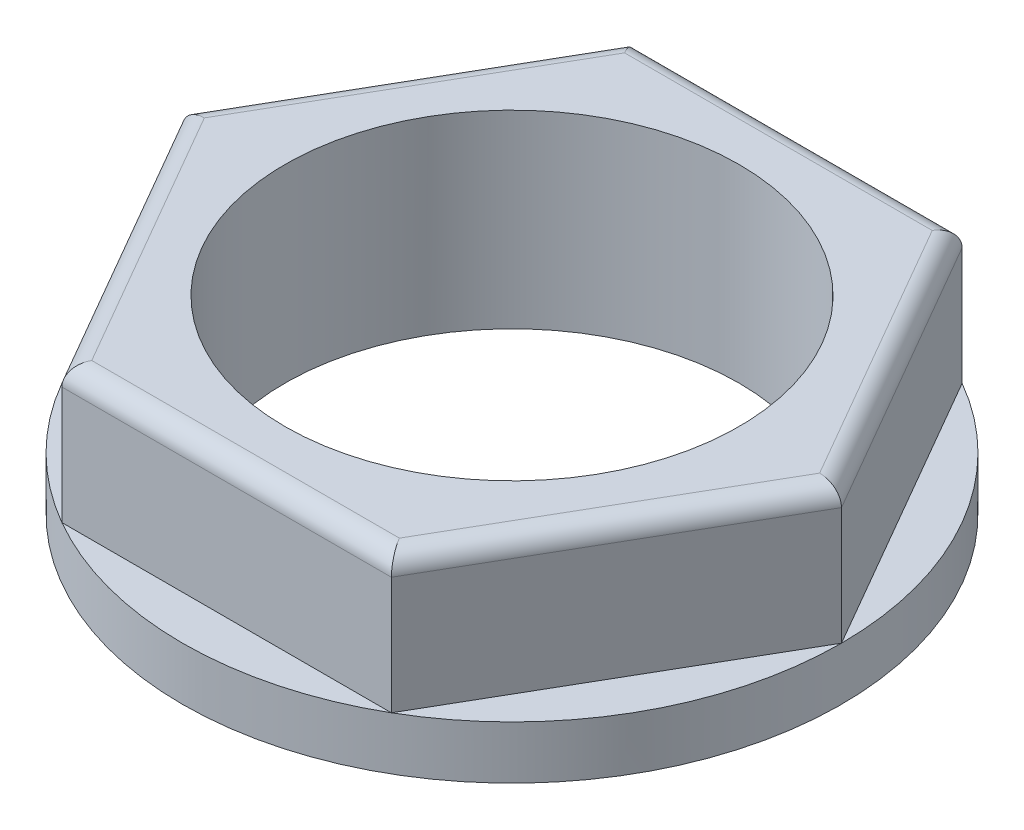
from build123d import *

# Parameters (mm, degrees)
SKETCH_1_R          = 8.7
EXTRUDE_1_DEPTH     = 1.4
BOSS_EXTRUDE1_DEPTH = 3.6
FILLET1_R           = 0.5
SKETCH3_R           = 5.9944
CUT_EXTRUDE1_DEPTH  = 5


with BuildPart() as part:
    # Sketch 1 → Extrude 1 (new body)
    with BuildSketch(Plane(origin=(0, 0, 0), x_dir=(1, 0, 0), z_dir=(0, 1, 0))):
        with Locations(Location((0, 0, 0), (0, 0, 270))):
            Circle(SKETCH_1_R)
    extrude(amount=EXTRUDE_1_DEPTH)

    # Sketch2 → Boss-Extrude1 (add)
    with BuildSketch(Plane(origin=(0, 1.4, 0), x_dir=(1, 0, 0), z_dir=(0, 1, 0))):
        Polygon((4.35, 7.534421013), (-4.35, 7.534421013), (-8.7, 0), (-4.35, -7.534421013), (4.35, -7.534421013), (8.7, 0), align=None)
    extrude(amount=BOSS_EXTRUDE1_DEPTH)

    # Fillet1
    fillet1_edges = [part.edges().sort_by_distance(p)[0] for p in [
        (6.525, 5, -3.767210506),
        (0, 5, -7.534421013),
        (-6.525, 5, -3.767210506),
        (-6.525, 5, 3.767210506),
        (0, 5, 7.534421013),
        (6.525, 5, 3.767210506),
    ]]
    fillet(fillet1_edges, radius=FILLET1_R)

    # Sketch3 → Cut-Extrude1 (cut)
    with BuildSketch(Plane.XZ):
        with Locations(Location((0, 0, 0), (0, 0, 270))):
            Circle(SKETCH3_R)
    extrude(amount=-CUT_EXTRUDE1_DEPTH, mode=Mode.SUBTRACT)


solid = part.part
